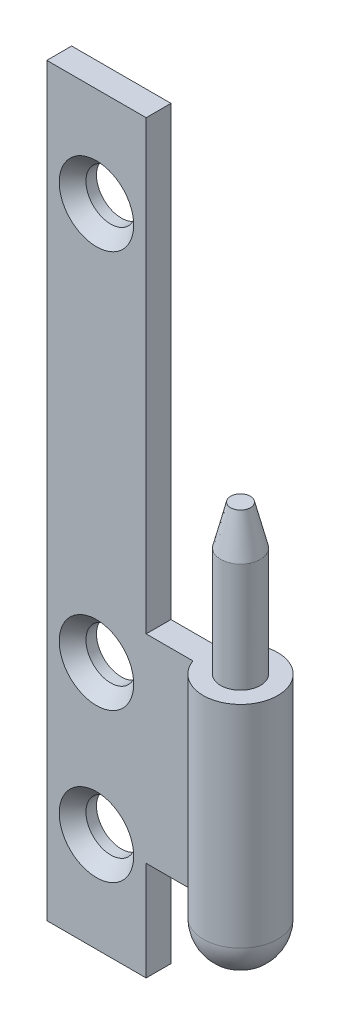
from build123d import *

# Parameters (mm, degrees)
ESQUISSE1_W          = 20
ESQUISSE1_H          = 150
BOSS_EXTRU_1_DEPTH   = 2.5
ESQUISSE2_W          = 5
ESQUISSE2_H          = 40
BOSS_EXTRU_2_DEPTH   = 10
CHANFREIN1_SIZE      = 8
CHANFREIN1_SIZE2     = 2
PER_AGE1_D           = 10
PER_AGE1_DEPTH       = 10
PER_AGE1_CSINK_D     = 15
PER_AGE1_CSINK_ANGLE = 82
PER_AGE1_TIP         = 3.004303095


with BuildPart() as part:
    # Esquisse1 → Boss.-Extru.1 (new, symmetric)
    with BuildSketch(Plane.XY):
        with Locations((10, 75)):
            Rectangle(ESQUISSE1_W, ESQUISSE1_H)
    extrude(amount=BOSS_EXTRU_1_DEPTH, both=True)

    # Esquisse2 → Boss.-Extru.2 (add)
    with BuildSketch(Plane(origin=(20, 0, 0), x_dir=(0, 0, -1), z_dir=(1, 0, 0))):
        with Locations((0, 40)):
            Rectangle(ESQUISSE2_W, ESQUISSE2_H)
    extrude(amount=BOSS_EXTRU_2_DEPTH)

    # Esquisse3 → R_volution1 (revolve)
    with BuildSketch(Plane.XY):
        with BuildLine():
            Line((36.5, 90), (32.5, 90))
            Line((32.5, 90), (32.5, 60))
            Line((32.5, 60), (29, 60))
            Line((29, 60), (29, 17.5))
            ThreePointArc((29, 17.5), (31.196699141, 12.196699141), (36.5, 10))
            Line((36.5, 10), (36.5, 90))
        make_face()
    revolve(axis=Axis((36.5, 90, 0), (0, -1, 0)))

    # Chanfrein1
    chanfrein1_edges = [part.edges().sort_by_distance(p)[0] for p in [
        (40.5, 90, 0),
    ]]
    chanfrein1_side = [part.faces().sort_by_distance(p)[0] for p in [
        (40.5, 75, 0),
    ]]
    chamfer(chanfrein1_edges, length=CHANFREIN1_SIZE, length2=CHANFREIN1_SIZE2, reference=chanfrein1_side[0])

    # Per_age1
    with Locations(Plane.XY.offset(2.5)):
        with Locations((10, 20), (10, 50), (10, 130)):
            CounterSinkHole(PER_AGE1_D / 2, PER_AGE1_CSINK_D / 2, depth=PER_AGE1_DEPTH, counter_sink_angle=PER_AGE1_CSINK_ANGLE)
            with Locations((0, 0, -(PER_AGE1_DEPTH + PER_AGE1_TIP / 2))):  # 118° drill point
                Cone(0, PER_AGE1_D / 2, PER_AGE1_TIP, mode=Mode.SUBTRACT)


solid = part.part
